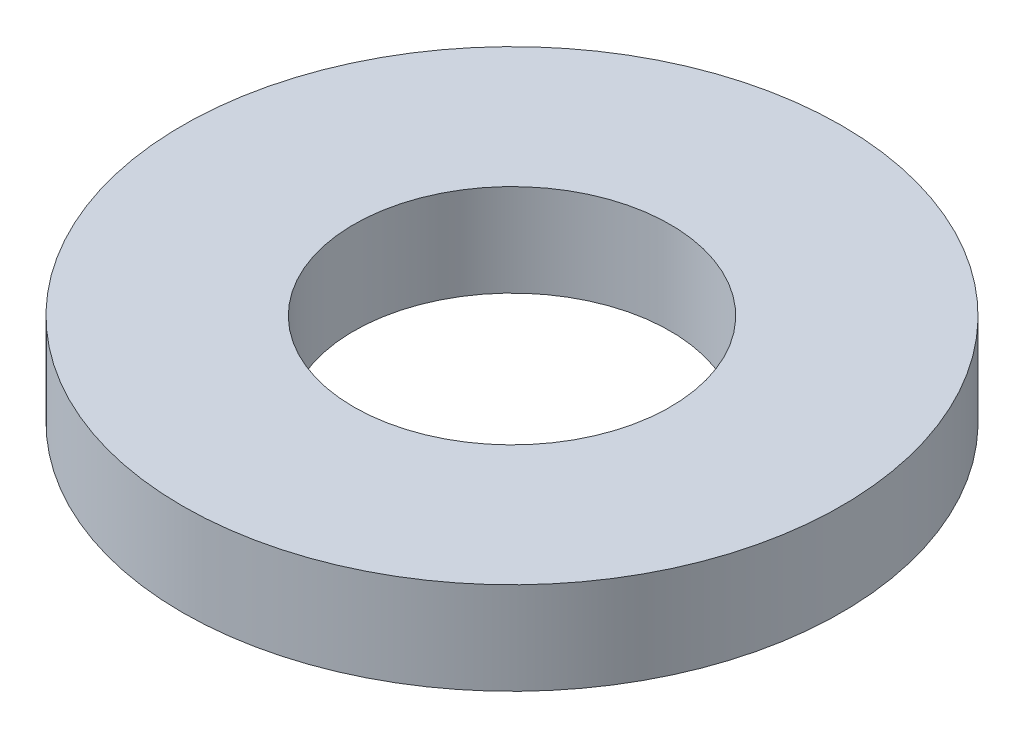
ISO-10303-21;
HEADER;
FILE_DESCRIPTION(('STEP AP214'),'2;1');
FILE_NAME('part.step','',(''),(''),'','','');
FILE_SCHEMA(('AUTOMOTIVE_DESIGN { 1 0 10303 214 1 1 1 1 }'));
ENDSEC;
DATA;
#1=APPLICATION_CONTEXT('core data for automotive mechanical design processes');
#2=APPLICATION_PROTOCOL_DEFINITION('international standard','automotive_design',2000,#1);
#3=PRODUCT_CONTEXT('',#1,'mechanical');
#4=PRODUCT('Part','Part','',(#3));
#5=PRODUCT_RELATED_PRODUCT_CATEGORY('part','',(#4));
#6=PRODUCT_DEFINITION_FORMATION('','',#4);
#7=PRODUCT_DEFINITION_CONTEXT('part definition',#1,'design');
#8=PRODUCT_DEFINITION('design','',#6,#7);
#9=PRODUCT_DEFINITION_SHAPE('','',#8);
#10=(LENGTH_UNIT() NAMED_UNIT(*) SI_UNIT(.MILLI.,.METRE.));
#11=(NAMED_UNIT(*) PLANE_ANGLE_UNIT() SI_UNIT($,.RADIAN.));
#12=(NAMED_UNIT(*) SI_UNIT($,.STERADIAN.) SOLID_ANGLE_UNIT());
#13=UNCERTAINTY_MEASURE_WITH_UNIT(LENGTH_MEASURE(1.E-05),#10,'distance_accuracy_value','');
#14=(GEOMETRIC_REPRESENTATION_CONTEXT(3) GLOBAL_UNCERTAINTY_ASSIGNED_CONTEXT((#13)) GLOBAL_UNIT_ASSIGNED_CONTEXT((#10,
#11,#12)) REPRESENTATION_CONTEXT('',''));
#15=CARTESIAN_POINT('',(0.,0.,0.));
#16=DIRECTION('',(0.,0.,1.));
#17=DIRECTION('',(1.,0.,0.));
#18=AXIS2_PLACEMENT_3D('',#15,#16,#17);
#19=CARTESIAN_POINT('',(0.,0.889,0.));
#20=DIRECTION('',(0.,1.,0.));
#21=DIRECTION('',(0.,0.,1.));
#22=AXIS2_PLACEMENT_3D('',#19,#20,#21);
#23=PLANE('',#22);
#24=CARTESIAN_POINT('',(0.,0.889,0.));
#25=DIRECTION('',(0.,1.,0.));
#26=DIRECTION('',(0.,0.,1.));
#27=AXIS2_PLACEMENT_3D('',#24,#25,#26);
#28=CIRCLE('',#27,3.175);
#29=CARTESIAN_POINT('',(0.,0.889,3.175));
#30=VERTEX_POINT('',#29);
#31=EDGE_CURVE('E10',#30,#30,#28,.T.);
#32=ORIENTED_EDGE('',*,*,#31,.T.);
#33=EDGE_LOOP('',(#32));
#34=FACE_BOUND('',#33,.T.);
#35=CARTESIAN_POINT('',(0.,0.889,0.));
#36=DIRECTION('',(0.,1.,0.));
#37=DIRECTION('',(0.,0.,1.));
#38=AXIS2_PLACEMENT_3D('',#35,#36,#37);
#39=CIRCLE('',#38,1.524);
#40=CARTESIAN_POINT('',(0.,0.889,1.524));
#41=VERTEX_POINT('',#40);
#42=EDGE_CURVE('E45',#41,#41,#39,.T.);
#43=ORIENTED_EDGE('',*,*,#42,.F.);
#44=EDGE_LOOP('',(#43));
#45=FACE_BOUND('',#44,.T.);
#46=ADVANCED_FACE('F34',(#34,#45),#23,.T.);
#47=CARTESIAN_POINT('',(0.,0.,0.));
#48=DIRECTION('',(0.,1.,0.));
#49=DIRECTION('',(0.,0.,1.));
#50=AXIS2_PLACEMENT_3D('',#47,#48,#49);
#51=PLANE('',#50);
#52=CARTESIAN_POINT('',(0.,0.,0.));
#53=DIRECTION('',(0.,1.,0.));
#54=DIRECTION('',(0.,0.,1.));
#55=AXIS2_PLACEMENT_3D('',#52,#53,#54);
#56=CIRCLE('',#55,3.175);
#57=CARTESIAN_POINT('',(0.,0.,3.175));
#58=VERTEX_POINT('',#57);
#59=EDGE_CURVE('E38',#58,#58,#56,.T.);
#60=ORIENTED_EDGE('',*,*,#59,.F.);
#61=EDGE_LOOP('',(#60));
#62=FACE_BOUND('',#61,.T.);
#63=CARTESIAN_POINT('',(0.,0.,0.));
#64=DIRECTION('',(0.,1.,0.));
#65=DIRECTION('',(0.,0.,1.));
#66=AXIS2_PLACEMENT_3D('',#63,#64,#65);
#67=CIRCLE('',#66,1.524);
#68=CARTESIAN_POINT('',(0.,0.,1.524));
#69=VERTEX_POINT('',#68);
#70=EDGE_CURVE('E47',#69,#69,#67,.T.);
#71=ORIENTED_EDGE('',*,*,#70,.T.);
#72=EDGE_LOOP('',(#71));
#73=FACE_BOUND('',#72,.T.);
#74=ADVANCED_FACE('F57',(#62,#73),#51,.F.);
#75=CARTESIAN_POINT('',(0.,0.889,0.));
#76=DIRECTION('',(0.,-1.,0.));
#77=DIRECTION('',(0.,0.,-1.));
#78=AXIS2_PLACEMENT_3D('',#75,#76,#77);
#79=CYLINDRICAL_SURFACE('',#78,3.175);
#80=ORIENTED_EDGE('',*,*,#31,.F.);
#81=EDGE_LOOP('',(#80));
#82=FACE_BOUND('',#81,.T.);
#83=ORIENTED_EDGE('',*,*,#59,.T.);
#84=EDGE_LOOP('',(#83));
#85=FACE_BOUND('',#84,.T.);
#86=ADVANCED_FACE('F36',(#82,#85),#79,.T.);
#87=CARTESIAN_POINT('',(0.,0.889,0.));
#88=DIRECTION('',(0.,-1.,0.));
#89=DIRECTION('',(0.,0.,-1.));
#90=AXIS2_PLACEMENT_3D('',#87,#88,#89);
#91=CYLINDRICAL_SURFACE('',#90,1.524);
#92=ORIENTED_EDGE('',*,*,#42,.T.);
#93=EDGE_LOOP('',(#92));
#94=FACE_BOUND('',#93,.T.);
#95=ORIENTED_EDGE('',*,*,#70,.F.);
#96=EDGE_LOOP('',(#95));
#97=FACE_BOUND('',#96,.T.);
#98=ADVANCED_FACE('F53',(#94,#97),#91,.F.);
#99=CLOSED_SHELL('',(#46,#74,#86,#98));
#100=MANIFOLD_SOLID_BREP('B2',#99);
#101=ADVANCED_BREP_SHAPE_REPRESENTATION('',(#18,#100),#14);
#102=SHAPE_DEFINITION_REPRESENTATION(#9,#101);
ENDSEC;
END-ISO-10303-21;
